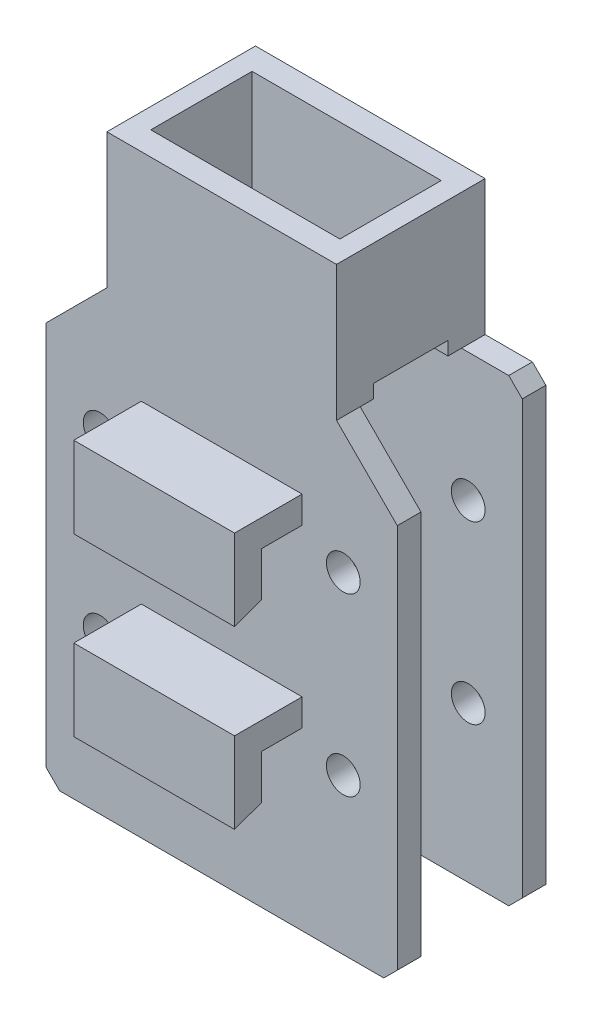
from build123d import *

# Parameters (mm, degrees)
EXTRUDE_1_DEPTH          = 11
CUT_EXTRUDE_1_DEPTH      = 7.5
SKETCH_3_W               = 34
SKETCH_3_H               = 22
SKETCH_3_W_2             = 28
SKETCH_3_H_2             = 15
EXTRUDE_2_DEPTH          = 20
CUT_EXTRUDE_2_DEPTH      = 61.934390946
CUT_EXTRUDE_2_DEPTH_BACK = 61.934390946
SKETCH_6_R               = 2.5
CUT_EXTRUDE_3_DEPTH      = 70.899928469
CUT_EXTRUDE_3_DEPTH_BACK = 70.899928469
SKETCH_7_W               = 11
SKETCH_7_H               = 4
SKETCH_8_R               = 2.5
CUT_EXTRUDE_4_DEPTH      = 64.843558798
HOLE_WIZARD_M8_1_D       = 6.8
EXTRUDE_3_DEPTH          = 11.9
PATTERN_LINEAR_1_COUNT   = 2
PATTERN_LINEAR_1_PITCH   = 26
CUT_EXTRUDE_5_REACH      = 65.844


with BuildPart() as part:
    # Sketch 1 → Extrude 1 (new, symmetric)
    with BuildSketch(Plane.XY):
        Polygon((-24, 34), (-26, 32), (-26, -32), (-24, -34), (24, -34), (26, -32), (26, 32), (24, 34), align=None)
    extrude(amount=EXTRUDE_1_DEPTH, both=True)

    # Sketch 2 → Cut-Extrude 1 (cut, symmetric)
    with BuildSketch(Plane.XY):
        Polygon((24, 34), (-24, 34), (-26, 32), (-26, -32), (-24, -34), (24, -34), (26, -32), (26, 32), align=None)
    extrude(amount=CUT_EXTRUDE_1_DEPTH, both=True, mode=Mode.SUBTRACT)


with BuildPart() as cut_extrude_1_piece_1:
    # of the separate pieces the step leaves, piece 1, a body of its own (cut_extrude_1_pieces)
    add(part.part.solids().sort_by_distance((-24, 34, -7.5))[0])



with BuildPart() as cut_extrude_1_piece_2:
    # of the separate pieces the step leaves, piece 2, a body of its own (cut_extrude_1_pieces)
    add(part.part.solids().sort_by_distance((-24, 34, 11))[0])


with BuildPart() as cut_extrude_1_piece_1_1:
    add(cut_extrude_1_piece_1.part)

    add(cut_extrude_1_piece_2.part)  # Extrude 2 merges Cut-Extrude 1 piece 2
    # Sketch 3 → Extrude 2 (add)
    with BuildSketch(Plane(origin=(0, 34, 0), x_dir=(1, 0, 0), z_dir=(0, 1, 0))):
        Rectangle(SKETCH_3_W, SKETCH_3_H)
        Rectangle(SKETCH_3_W_2, SKETCH_3_H_2, mode=Mode.SUBTRACT)
    extrude(amount=EXTRUDE_2_DEPTH)

    # Sketch 6 → Cut-Extrude 2 (cut, two sides: drawn at the far end of the back side and taken through both)
    with BuildSketch(Plane.XY.offset(-CUT_EXTRUDE_2_DEPTH_BACK)):
        with Locations((-18, 15)):
            Circle(SKETCH_6_R)
        with Locations(Location((18, 15, 0), (0, 0, 180))):
            Circle(SKETCH_6_R)
    extrude(amount=CUT_EXTRUDE_2_DEPTH + CUT_EXTRUDE_2_DEPTH_BACK, mode=Mode.SUBTRACT)

    # Sketch 7 → Cut-Extrude 3 (cut, two sides: drawn at the far end of the back side and taken through both)
    with BuildSketch(Plane.ZY.offset(17).offset(-CUT_EXTRUDE_3_DEPTH_BACK)):
        with Locations((0, 34)):
            Rectangle(SKETCH_7_W, SKETCH_7_H)
    extrude(amount=CUT_EXTRUDE_3_DEPTH + CUT_EXTRUDE_3_DEPTH_BACK, mode=Mode.SUBTRACT)

    # Sketch 8 → Cut-Extrude 4 (cut, through all)
    with BuildSketch(Plane.XY.offset(11)):
        with Locations((-18, -11)):
            Circle(SKETCH_8_R)
        with Locations(Location((18, -11, 0), (0, 0, 180))):
            Circle(SKETCH_8_R)
    extrude(amount=-CUT_EXTRUDE_4_DEPTH, mode=Mode.SUBTRACT)

    # Hole Wizard M8 _1 (through all)
    with Locations(Plane(origin=(0, -22, 11), x_dir=(1, 0, 0), z_dir=(0, 0, 1))):
        with Locations((0, 0)):
            Hole(HOLE_WIZARD_M8_1_D / 2)

    # Sketch 11 → Extrude 3 (add, symmetric)
    with BuildSketch(Plane(origin=(0, 0, 0), x_dir=(0, 0, -1), z_dir=(1, 0, 0))):
        Polygon((-11, -4), (-21, -4), (-21, -16), (-17, -14.544119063), (-17, -8), (-11, -8), align=None)
    extrude_3 = extrude(amount=EXTRUDE_3_DEPTH, both=True)

    # Pattern Linear 1: Extrude 3 ×2
    with Locations(*[(0, i * PATTERN_LINEAR_1_PITCH, 0) for i in range(1, PATTERN_LINEAR_1_COUNT)]):
        add(extrude_3)

    # Sketch 13 → Cut-Extrude 5 (cut, up to next)
    with BuildSketch(Plane.XY.offset(11), mode=Mode.PRIVATE) as cut_extrude_5_sk1:
        Polygon((17, 34), (26, 25), (26, 32), (24, 34), align=None)
    cut_extrude_5_tool1 = extrude(cut_extrude_5_sk1.sketch, amount=-CUT_EXTRUDE_5_REACH, mode=Mode.PRIVATE) & cut_extrude_1_piece_1_1.part
    # Sketch 13 → Cut-Extrude 5 (cut, up to next)
    with BuildSketch(Plane.XY.offset(11), mode=Mode.PRIVATE) as cut_extrude_5_sk2:
        Polygon((-24, 34), (-17, 34), (-26, 25), (-26, 32), align=None)
    cut_extrude_5_tool2 = extrude(cut_extrude_5_sk2.sketch, amount=-CUT_EXTRUDE_5_REACH, mode=Mode.PRIVATE) & cut_extrude_1_piece_1_1.part
    add(cut_extrude_5_tool1.solids().sort_by_distance((22.878788, 30.878788, 11))[0], mode=Mode.SUBTRACT)
    add(cut_extrude_5_tool2.solids().sort_by_distance((-22.878788, 30.878788, 11))[0], mode=Mode.SUBTRACT)


solid = cut_extrude_1_piece_1_1.part
